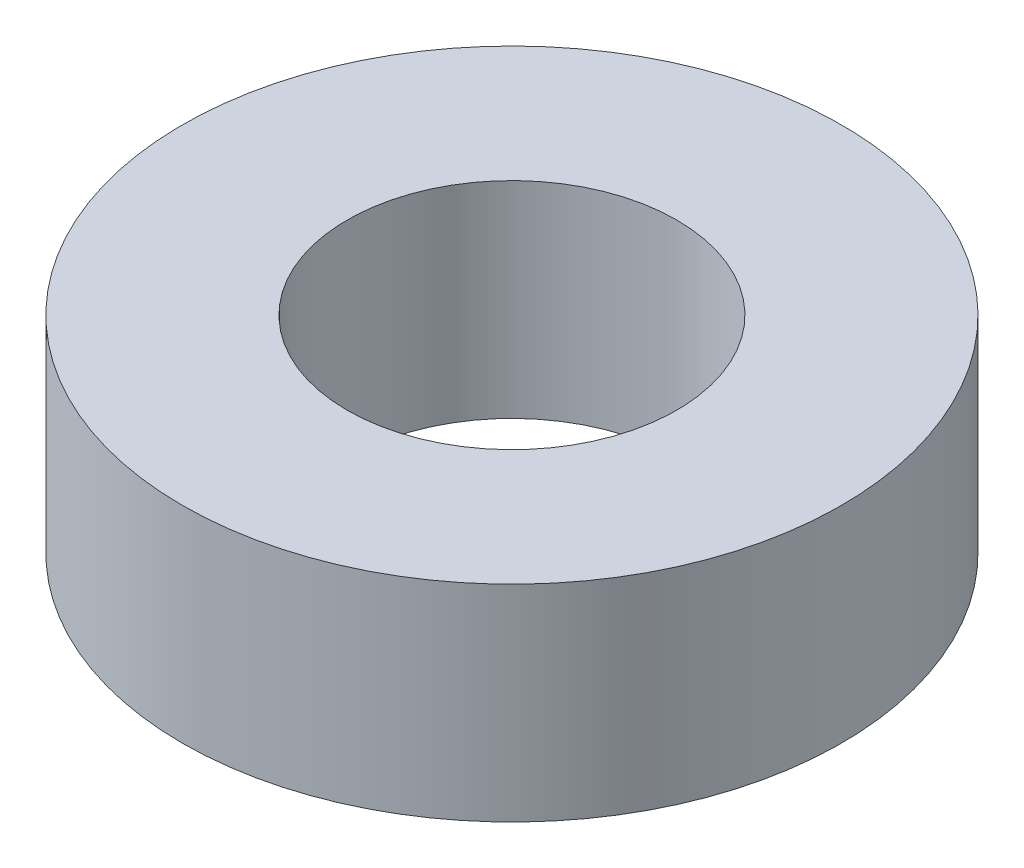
from build123d import *

# Parameters (mm, degrees)
SKETCH1_R           = 4
SKETCH1_R_2         = 2
BOSS_EXTRUDE1_DEPTH = 2.5


with BuildPart() as part:
    # Sketch1 → Boss-Extrude1 (new body)
    with BuildSketch(Plane(origin=(0, 0, 0), x_dir=(1, 0, 0), z_dir=(0, 1, 0))):
        with Locations(Location((0, 0, 0), (0, 0, 270))):
            Circle(SKETCH1_R)
        with Locations(Location((0, 0, 0), (0, 0, 270))):
            Circle(SKETCH1_R_2, mode=Mode.SUBTRACT)
    extrude(amount=BOSS_EXTRUDE1_DEPTH)


solid = part.part
